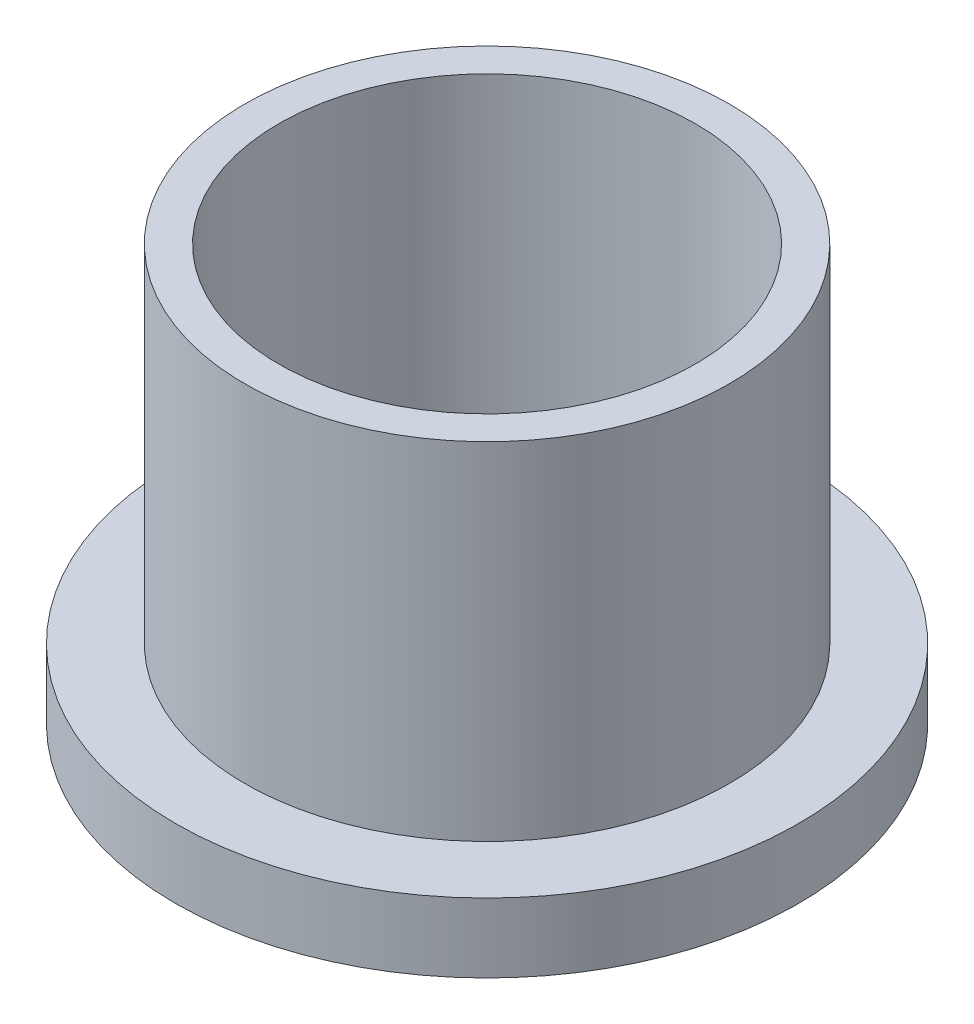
ISO-10303-21;
HEADER;
FILE_DESCRIPTION(('STEP AP214'),'2;1');
FILE_NAME('part.step','',(''),(''),'','','');
FILE_SCHEMA(('AUTOMOTIVE_DESIGN { 1 0 10303 214 1 1 1 1 }'));
ENDSEC;
DATA;
#1=APPLICATION_CONTEXT('core data for automotive mechanical design processes');
#2=APPLICATION_PROTOCOL_DEFINITION('international standard','automotive_design',2000,#1);
#3=PRODUCT_CONTEXT('',#1,'mechanical');
#4=PRODUCT('Part','Part','',(#3));
#5=PRODUCT_RELATED_PRODUCT_CATEGORY('part','',(#4));
#6=PRODUCT_DEFINITION_FORMATION('','',#4);
#7=PRODUCT_DEFINITION_CONTEXT('part definition',#1,'design');
#8=PRODUCT_DEFINITION('design','',#6,#7);
#9=PRODUCT_DEFINITION_SHAPE('','',#8);
#10=(LENGTH_UNIT() NAMED_UNIT(*) SI_UNIT(.MILLI.,.METRE.));
#11=(NAMED_UNIT(*) PLANE_ANGLE_UNIT() SI_UNIT($,.RADIAN.));
#12=(NAMED_UNIT(*) SI_UNIT($,.STERADIAN.) SOLID_ANGLE_UNIT());
#13=UNCERTAINTY_MEASURE_WITH_UNIT(LENGTH_MEASURE(1.E-05),#10,'distance_accuracy_value','');
#14=(GEOMETRIC_REPRESENTATION_CONTEXT(3) GLOBAL_UNCERTAINTY_ASSIGNED_CONTEXT((#13)) GLOBAL_UNIT_ASSIGNED_CONTEXT((#10,
#11,#12)) REPRESENTATION_CONTEXT('',''));
#15=CARTESIAN_POINT('',(0.,0.,0.));
#16=DIRECTION('',(0.,0.,1.));
#17=DIRECTION('',(1.,0.,0.));
#18=AXIS2_PLACEMENT_3D('',#15,#16,#17);
#19=CARTESIAN_POINT('',(0.,19.05,0.));
#20=DIRECTION('',(0.,1.,0.));
#21=DIRECTION('',(0.,0.,1.));
#22=AXIS2_PLACEMENT_3D('',#19,#20,#21);
#23=PLANE('',#22);
#24=CARTESIAN_POINT('',(0.,19.05,0.));
#25=DIRECTION('',(0.,1.,0.));
#26=DIRECTION('',(0.,0.,1.));
#27=AXIS2_PLACEMENT_3D('',#24,#25,#26);
#28=CIRCLE('',#27,11.1125);
#29=CARTESIAN_POINT('',(0.,19.05,-11.1125));
#30=VERTEX_POINT('',#29);
#31=EDGE_CURVE('E10',#30,#30,#28,.T.);
#32=ORIENTED_EDGE('',*,*,#31,.T.);
#33=EDGE_LOOP('',(#32));
#34=FACE_BOUND('',#33,.T.);
#35=CARTESIAN_POINT('',(0.,19.05,0.));
#36=DIRECTION('',(0.,1.,0.));
#37=DIRECTION('',(0.,0.,1.));
#38=AXIS2_PLACEMENT_3D('',#35,#36,#37);
#39=CIRCLE('',#38,9.5504);
#40=CARTESIAN_POINT('',(0.,19.05,-9.5504));
#41=VERTEX_POINT('',#40);
#42=EDGE_CURVE('E37',#41,#41,#39,.T.);
#43=ORIENTED_EDGE('',*,*,#42,.F.);
#44=EDGE_LOOP('',(#43));
#45=FACE_BOUND('',#44,.T.);
#46=ADVANCED_FACE('F30',(#34,#45),#23,.T.);
#47=CARTESIAN_POINT('',(0.,0.,0.));
#48=DIRECTION('',(0.,1.,0.));
#49=DIRECTION('',(0.,0.,1.));
#50=AXIS2_PLACEMENT_3D('',#47,#48,#49);
#51=PLANE('',#50);
#52=CARTESIAN_POINT('',(0.,0.,0.));
#53=DIRECTION('',(0.,1.,0.));
#54=DIRECTION('',(0.,0.,1.));
#55=AXIS2_PLACEMENT_3D('',#52,#53,#54);
#56=CIRCLE('',#55,9.5504);
#57=CARTESIAN_POINT('',(0.,0.,-9.5504));
#58=VERTEX_POINT('',#57);
#59=EDGE_CURVE('E41',#58,#58,#56,.T.);
#60=ORIENTED_EDGE('',*,*,#59,.T.);
#61=EDGE_LOOP('',(#60));
#62=FACE_BOUND('',#61,.T.);
#63=CARTESIAN_POINT('',(0.,0.,0.));
#64=DIRECTION('',(0.,1.,0.));
#65=DIRECTION('',(0.,0.,1.));
#66=AXIS2_PLACEMENT_3D('',#63,#64,#65);
#67=CIRCLE('',#66,14.2875);
#68=CARTESIAN_POINT('',(0.,0.,14.2875));
#69=VERTEX_POINT('',#68);
#70=EDGE_CURVE('E48',#69,#69,#67,.T.);
#71=ORIENTED_EDGE('',*,*,#70,.F.);
#72=EDGE_LOOP('',(#71));
#73=FACE_BOUND('',#72,.T.);
#74=ADVANCED_FACE('F73',(#62,#73),#51,.F.);
#75=CARTESIAN_POINT('',(0.,19.05,0.));
#76=DIRECTION('',(0.,-1.,0.));
#77=DIRECTION('',(0.,0.,-1.));
#78=AXIS2_PLACEMENT_3D('',#75,#76,#77);
#79=CYLINDRICAL_SURFACE('',#78,11.1125);
#80=CARTESIAN_POINT('',(0.,3.175,0.));
#81=DIRECTION('',(0.,1.,0.));
#82=DIRECTION('',(0.,0.,1.));
#83=AXIS2_PLACEMENT_3D('',#80,#81,#82);
#84=CIRCLE('',#83,11.1125);
#85=CARTESIAN_POINT('',(0.,3.175,-11.1125));
#86=VERTEX_POINT('',#85);
#87=EDGE_CURVE('E51',#86,#86,#84,.T.);
#88=CARTESIAN_POINT('',(0.,3.175,-11.1125));
#89=CARTESIAN_POINT('',(0.,3.34036458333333,-11.1125));
#90=CARTESIAN_POINT('',(0.,3.50572916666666,-11.1125));
#91=CARTESIAN_POINT('',(0.,3.83645833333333,-11.1125));
#92=CARTESIAN_POINT('',(0.,4.00182291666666,-11.1125));
#93=CARTESIAN_POINT('',(0.,4.33255208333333,-11.1125));
#94=CARTESIAN_POINT('',(0.,4.49791666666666,-11.1125));
#95=CARTESIAN_POINT('',(0.,4.82864583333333,-11.1125));
#96=CARTESIAN_POINT('',(0.,4.99401041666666,-11.1125));
#97=CARTESIAN_POINT('',(0.,5.32473958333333,-11.1125));
#98=CARTESIAN_POINT('',(0.,5.49010416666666,-11.1125));
#99=CARTESIAN_POINT('',(0.,5.82083333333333,-11.1125));
#100=CARTESIAN_POINT('',(0.,5.98619791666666,-11.1125));
#101=CARTESIAN_POINT('',(0.,6.31692708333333,-11.1125));
#102=CARTESIAN_POINT('',(0.,6.48229166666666,-11.1125));
#103=CARTESIAN_POINT('',(0.,6.81302083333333,-11.1125));
#104=CARTESIAN_POINT('',(0.,6.97838541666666,-11.1125));
#105=CARTESIAN_POINT('',(0.,7.30911458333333,-11.1125));
#106=CARTESIAN_POINT('',(0.,7.47447916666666,-11.1125));
#107=CARTESIAN_POINT('',(0.,7.80520833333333,-11.1125));
#108=CARTESIAN_POINT('',(0.,7.97057291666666,-11.1125));
#109=CARTESIAN_POINT('',(0.,8.30130208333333,-11.1125));
#110=CARTESIAN_POINT('',(0.,8.46666666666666,-11.1125));
#111=CARTESIAN_POINT('',(0.,8.79739583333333,-11.1125));
#112=CARTESIAN_POINT('',(0.,8.96276041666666,-11.1125));
#113=CARTESIAN_POINT('',(0.,9.29348958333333,-11.1125));
#114=CARTESIAN_POINT('',(0.,9.45885416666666,-11.1125));
#115=CARTESIAN_POINT('',(0.,9.78958333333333,-11.1125));
#116=CARTESIAN_POINT('',(0.,9.95494791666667,-11.1125));
#117=CARTESIAN_POINT('',(0.,10.2856770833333,-11.1125));
#118=CARTESIAN_POINT('',(0.,10.4510416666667,-11.1125));
#119=CARTESIAN_POINT('',(0.,10.7817708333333,-11.1125));
#120=CARTESIAN_POINT('',(0.,10.9471354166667,-11.1125));
#121=CARTESIAN_POINT('',(0.,11.2778645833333,-11.1125));
#122=CARTESIAN_POINT('',(0.,11.4432291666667,-11.1125));
#123=CARTESIAN_POINT('',(0.,11.7739583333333,-11.1125));
#124=CARTESIAN_POINT('',(0.,11.9393229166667,-11.1125));
#125=CARTESIAN_POINT('',(0.,12.2700520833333,-11.1125));
#126=CARTESIAN_POINT('',(0.,12.4354166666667,-11.1125));
#127=CARTESIAN_POINT('',(0.,12.7661458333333,-11.1125));
#128=CARTESIAN_POINT('',(0.,12.9315104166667,-11.1125));
#129=CARTESIAN_POINT('',(0.,13.2622395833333,-11.1125));
#130=CARTESIAN_POINT('',(0.,13.4276041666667,-11.1125));
#131=CARTESIAN_POINT('',(0.,13.7583333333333,-11.1125));
#132=CARTESIAN_POINT('',(0.,13.9236979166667,-11.1125));
#133=CARTESIAN_POINT('',(0.,14.2544270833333,-11.1125));
#134=CARTESIAN_POINT('',(0.,14.4197916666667,-11.1125));
#135=CARTESIAN_POINT('',(0.,14.7505208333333,-11.1125));
#136=CARTESIAN_POINT('',(0.,14.9158854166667,-11.1125));
#137=CARTESIAN_POINT('',(0.,15.2466145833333,-11.1125));
#138=CARTESIAN_POINT('',(0.,15.4119791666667,-11.1125));
#139=CARTESIAN_POINT('',(0.,15.7427083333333,-11.1125));
#140=CARTESIAN_POINT('',(0.,15.9080729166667,-11.1125));
#141=CARTESIAN_POINT('',(0.,16.2388020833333,-11.1125));
#142=CARTESIAN_POINT('',(0.,16.4041666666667,-11.1125));
#143=CARTESIAN_POINT('',(0.,16.7348958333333,-11.1125));
#144=CARTESIAN_POINT('',(0.,16.9002604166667,-11.1125));
#145=CARTESIAN_POINT('',(0.,17.2309895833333,-11.1125));
#146=CARTESIAN_POINT('',(0.,17.3963541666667,-11.1125));
#147=CARTESIAN_POINT('',(0.,17.7270833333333,-11.1125));
#148=CARTESIAN_POINT('',(0.,17.8924479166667,-11.1125));
#149=CARTESIAN_POINT('',(0.,18.2231770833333,-11.1125));
#150=CARTESIAN_POINT('',(0.,18.3885416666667,-11.1125));
#151=CARTESIAN_POINT('',(0.,18.7192708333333,-11.1125));
#152=CARTESIAN_POINT('',(0.,18.8846354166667,-11.1125));
#153=CARTESIAN_POINT('',(0.,19.05,-11.1125));
#154=B_SPLINE_CURVE_WITH_KNOTS('',3,(#88,#89,#90,#91,#92,#93,#94,#95,#96,#97,#98,#99,#100,#101,
#102,#103,#104,#105,#106,#107,#108,#109,#110,#111,#112,#113,#114,#115,#116,#117,#118,#119,#120,
#121,#122,#123,#124,#125,#126,#127,#128,#129,#130,#131,#132,#133,#134,#135,#136,#137,#138,#139,
#140,#141,#142,#143,#144,#145,#146,#147,#148,#149,#150,#151,#152,#153),.UNSPECIFIED.,.F.,.F.,(4,
2,2,2,2,2,2,2,2,2,2,2,2,2,2,2,2,2,2,2,2,2,2,2,2,2,2,2,2,2,2,2,4),(0.,0.496093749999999,
0.992187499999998,1.48828125,1.984375,2.48046875,2.9765625,3.47265625,3.96875,4.46484375,
4.9609375,5.45703125,5.953125,6.44921875,6.9453125,7.44140625,7.9375,8.43359375,8.9296875,
9.42578125,9.921875,10.41796875,10.9140625,11.41015625,11.90625,12.40234375,12.8984375,
13.39453125,13.890625,14.38671875,14.8828125,15.37890625,15.875),.UNSPECIFIED.);
#155=EDGE_CURVE('BSEAM32',#86,#30,#154,.T.);
#156=ORIENTED_EDGE('',*,*,#87,.T.);
#157=ORIENTED_EDGE('',*,*,#31,.F.);
#158=ORIENTED_EDGE('',*,*,#155,.T.);
#159=ORIENTED_EDGE('',*,*,#155,.F.);
#160=EDGE_LOOP('',(#156,#158,#157,#159));
#161=FACE_BOUND('',#160,.T.);
#162=ADVANCED_FACE('F32',(#161),#79,.T.);
#163=CARTESIAN_POINT('',(0.,19.05,0.));
#164=DIRECTION('',(0.,-1.,0.));
#165=DIRECTION('',(0.,0.,-1.));
#166=AXIS2_PLACEMENT_3D('',#163,#164,#165);
#167=CYLINDRICAL_SURFACE('',#166,9.5504);
#168=CARTESIAN_POINT('',(0.,19.05,-9.5504));
#169=CARTESIAN_POINT('',(0.,18.8515625,-9.5504));
#170=CARTESIAN_POINT('',(0.,18.653125,-9.5504));
#171=CARTESIAN_POINT('',(0.,18.25625,-9.5504));
#172=CARTESIAN_POINT('',(0.,18.0578125,-9.5504));
#173=CARTESIAN_POINT('',(0.,17.6609375,-9.5504));
#174=CARTESIAN_POINT('',(0.,17.4625,-9.5504));
#175=CARTESIAN_POINT('',(0.,17.065625,-9.5504));
#176=CARTESIAN_POINT('',(0.,16.8671875,-9.5504));
#177=CARTESIAN_POINT('',(0.,16.4703125,-9.5504));
#178=CARTESIAN_POINT('',(0.,16.271875,-9.5504));
#179=CARTESIAN_POINT('',(0.,15.875,-9.5504));
#180=CARTESIAN_POINT('',(0.,15.6765625,-9.5504));
#181=CARTESIAN_POINT('',(0.,15.2796875,-9.5504));
#182=CARTESIAN_POINT('',(0.,15.08125,-9.5504));
#183=CARTESIAN_POINT('',(0.,14.684375,-9.5504));
#184=CARTESIAN_POINT('',(0.,14.4859375,-9.5504));
#185=CARTESIAN_POINT('',(0.,14.0890625,-9.5504));
#186=CARTESIAN_POINT('',(0.,13.890625,-9.5504));
#187=CARTESIAN_POINT('',(0.,13.49375,-9.5504));
#188=CARTESIAN_POINT('',(0.,13.2953125,-9.5504));
#189=CARTESIAN_POINT('',(0.,12.8984375,-9.5504));
#190=CARTESIAN_POINT('',(0.,12.7,-9.5504));
#191=CARTESIAN_POINT('',(0.,12.303125,-9.5504));
#192=CARTESIAN_POINT('',(0.,12.1046875,-9.5504));
#193=CARTESIAN_POINT('',(0.,11.7078125,-9.5504));
#194=CARTESIAN_POINT('',(0.,11.509375,-9.5504));
#195=CARTESIAN_POINT('',(0.,11.1125,-9.5504));
#196=CARTESIAN_POINT('',(0.,10.9140625,-9.5504));
#197=CARTESIAN_POINT('',(0.,10.5171875,-9.5504));
#198=CARTESIAN_POINT('',(0.,10.31875,-9.5504));
#199=CARTESIAN_POINT('',(0.,9.921875,-9.5504));
#200=CARTESIAN_POINT('',(0.,9.7234375,-9.5504));
#201=CARTESIAN_POINT('',(0.,9.3265625,-9.5504));
#202=CARTESIAN_POINT('',(0.,9.128125,-9.5504));
#203=CARTESIAN_POINT('',(0.,8.73125,-9.5504));
#204=CARTESIAN_POINT('',(0.,8.5328125,-9.5504));
#205=CARTESIAN_POINT('',(0.,8.1359375,-9.5504));
#206=CARTESIAN_POINT('',(0.,7.9375,-9.5504));
#207=CARTESIAN_POINT('',(0.,7.540625,-9.5504));
#208=CARTESIAN_POINT('',(0.,7.3421875,-9.5504));
#209=CARTESIAN_POINT('',(0.,6.9453125,-9.5504));
#210=CARTESIAN_POINT('',(0.,6.746875,-9.5504));
#211=CARTESIAN_POINT('',(0.,6.35,-9.5504));
#212=CARTESIAN_POINT('',(0.,6.1515625,-9.5504));
#213=CARTESIAN_POINT('',(0.,5.7546875,-9.5504));
#214=CARTESIAN_POINT('',(0.,5.55625,-9.5504));
#215=CARTESIAN_POINT('',(0.,5.159375,-9.5504));
#216=CARTESIAN_POINT('',(0.,4.9609375,-9.5504));
#217=CARTESIAN_POINT('',(0.,4.5640625,-9.5504));
#218=CARTESIAN_POINT('',(0.,4.365625,-9.5504));
#219=CARTESIAN_POINT('',(0.,3.96875,-9.5504));
#220=CARTESIAN_POINT('',(0.,3.7703125,-9.5504));
#221=CARTESIAN_POINT('',(0.,3.3734375,-9.5504));
#222=CARTESIAN_POINT('',(0.,3.175,-9.5504));
#223=CARTESIAN_POINT('',(0.,2.778125,-9.5504));
#224=CARTESIAN_POINT('',(0.,2.5796875,-9.5504));
#225=CARTESIAN_POINT('',(0.,2.1828125,-9.5504));
#226=CARTESIAN_POINT('',(0.,1.984375,-9.5504));
#227=CARTESIAN_POINT('',(0.,1.5875,-9.5504));
#228=CARTESIAN_POINT('',(0.,1.3890625,-9.5504));
#229=CARTESIAN_POINT('',(0.,0.992187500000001,-9.5504));
#230=CARTESIAN_POINT('',(0.,0.793750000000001,-9.5504));
#231=CARTESIAN_POINT('',(0.,0.396875,-9.5504));
#232=CARTESIAN_POINT('',(0.,0.1984375,-9.5504));
#233=CARTESIAN_POINT('',(0.,0.,-9.5504));
#234=B_SPLINE_CURVE_WITH_KNOTS('',3,(#168,#169,#170,#171,#172,#173,#174,#175,#176,#177,#178,
#179,#180,#181,#182,#183,#184,#185,#186,#187,#188,#189,#190,#191,#192,#193,#194,#195,#196,#197,
#198,#199,#200,#201,#202,#203,#204,#205,#206,#207,#208,#209,#210,#211,#212,#213,#214,#215,#216,
#217,#218,#219,#220,#221,#222,#223,#224,#225,#226,#227,#228,#229,#230,#231,#232,#233),
.UNSPECIFIED.,.F.,.F.,(4,2,2,2,2,2,2,2,2,2,2,2,2,2,2,2,2,2,2,2,2,2,2,2,2,2,2,2,2,2,2,2,4),(0.,
0.595312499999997,1.190625,1.7859375,2.38125,2.9765625,3.571875,4.1671875,4.7625,5.3578125,
5.953125,6.5484375,7.14375,7.7390625,8.334375,8.9296875,9.525,10.1203125,10.715625,11.3109375,
11.90625,12.5015625,13.096875,13.6921875,14.2875,14.8828125,15.478125,16.0734375,16.66875,
17.2640625,17.859375,18.4546875,19.05),.UNSPECIFIED.);
#235=EDGE_CURVE('BSEAM62',#41,#58,#234,.T.);
#236=ORIENTED_EDGE('',*,*,#42,.T.);
#237=ORIENTED_EDGE('',*,*,#59,.F.);
#238=ORIENTED_EDGE('',*,*,#235,.T.);
#239=ORIENTED_EDGE('',*,*,#235,.F.);
#240=EDGE_LOOP('',(#236,#238,#237,#239));
#241=FACE_BOUND('',#240,.T.);
#242=ADVANCED_FACE('F62',(#241),#167,.F.);
#243=CARTESIAN_POINT('',(0.,3.175,0.));
#244=DIRECTION('',(0.,1.,0.));
#245=DIRECTION('',(0.,0.,1.));
#246=AXIS2_PLACEMENT_3D('',#243,#244,#245);
#247=PLANE('',#246);
#248=CARTESIAN_POINT('',(0.,3.175,0.));
#249=DIRECTION('',(0.,1.,0.));
#250=DIRECTION('',(0.,0.,1.));
#251=AXIS2_PLACEMENT_3D('',#248,#249,#250);
#252=CIRCLE('',#251,14.2875);
#253=CARTESIAN_POINT('',(0.,3.175,14.2875));
#254=VERTEX_POINT('',#253);
#255=EDGE_CURVE('E46',#254,#254,#252,.T.);
#256=ORIENTED_EDGE('',*,*,#255,.T.);
#257=EDGE_LOOP('',(#256));
#258=FACE_BOUND('',#257,.T.);
#259=ORIENTED_EDGE('',*,*,#87,.F.);
#260=EDGE_LOOP('',(#259));
#261=FACE_BOUND('',#260,.T.);
#262=ADVANCED_FACE('F59',(#258,#261),#247,.T.);
#263=CARTESIAN_POINT('',(0.,3.175,0.));
#264=DIRECTION('',(0.,-1.,0.));
#265=DIRECTION('',(0.,0.,-1.));
#266=AXIS2_PLACEMENT_3D('',#263,#264,#265);
#267=CYLINDRICAL_SURFACE('',#266,14.2875);
#268=ORIENTED_EDGE('',*,*,#255,.F.);
#269=EDGE_LOOP('',(#268));
#270=FACE_BOUND('',#269,.T.);
#271=ORIENTED_EDGE('',*,*,#70,.T.);
#272=EDGE_LOOP('',(#271));
#273=FACE_BOUND('',#272,.T.);
#274=ADVANCED_FACE('F61',(#270,#273),#267,.T.);
#275=CLOSED_SHELL('',(#46,#74,#162,#242,#262,#274));
#276=MANIFOLD_SOLID_BREP('B2',#275);
#277=ADVANCED_BREP_SHAPE_REPRESENTATION('',(#18,#276),#14);
#278=SHAPE_DEFINITION_REPRESENTATION(#9,#277);
ENDSEC;
END-ISO-10303-21;
